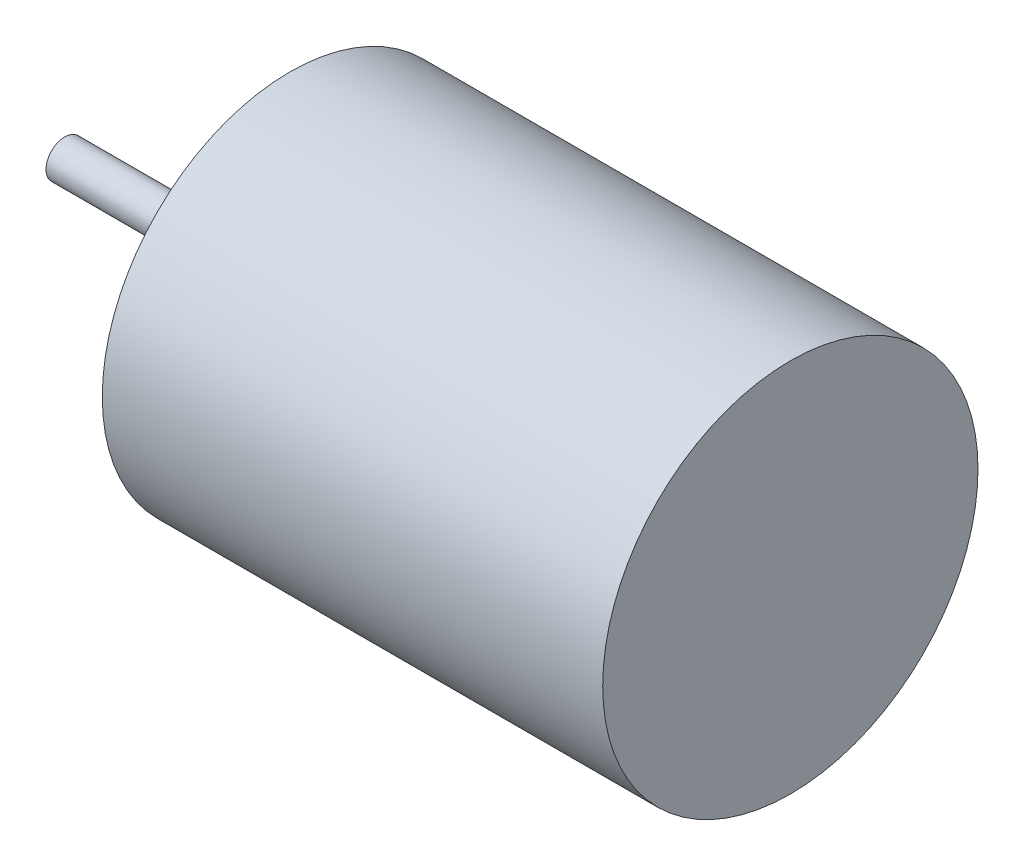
ISO-10303-21;
HEADER;
FILE_DESCRIPTION(('STEP AP214'),'2;1');
FILE_NAME('part.step','',(''),(''),'','','');
FILE_SCHEMA(('AUTOMOTIVE_DESIGN { 1 0 10303 214 1 1 1 1 }'));
ENDSEC;
DATA;
#1=APPLICATION_CONTEXT('core data for automotive mechanical design processes');
#2=APPLICATION_PROTOCOL_DEFINITION('international standard','automotive_design',2000,#1);
#3=PRODUCT_CONTEXT('',#1,'mechanical');
#4=PRODUCT('Part','Part','',(#3));
#5=PRODUCT_RELATED_PRODUCT_CATEGORY('part','',(#4));
#6=PRODUCT_DEFINITION_FORMATION('','',#4);
#7=PRODUCT_DEFINITION_CONTEXT('part definition',#1,'design');
#8=PRODUCT_DEFINITION('design','',#6,#7);
#9=PRODUCT_DEFINITION_SHAPE('','',#8);
#10=(LENGTH_UNIT() NAMED_UNIT(*) SI_UNIT(.MILLI.,.METRE.));
#11=(NAMED_UNIT(*) PLANE_ANGLE_UNIT() SI_UNIT($,.RADIAN.));
#12=(NAMED_UNIT(*) SI_UNIT($,.STERADIAN.) SOLID_ANGLE_UNIT());
#13=UNCERTAINTY_MEASURE_WITH_UNIT(LENGTH_MEASURE(1.E-05),#10,'distance_accuracy_value','');
#14=(GEOMETRIC_REPRESENTATION_CONTEXT(3) GLOBAL_UNCERTAINTY_ASSIGNED_CONTEXT((#13)) GLOBAL_UNIT_ASSIGNED_CONTEXT((#10,
#11,#12)) REPRESENTATION_CONTEXT('',''));
#15=CARTESIAN_POINT('',(0.,0.,0.));
#16=DIRECTION('',(0.,0.,1.));
#17=DIRECTION('',(1.,0.,0.));
#18=AXIS2_PLACEMENT_3D('',#15,#16,#17);
#19=CARTESIAN_POINT('',(35.,5.,-260.));
#20=DIRECTION('',(-1.,0.,0.));
#21=DIRECTION('',(0.,0.,1.));
#22=AXIS2_PLACEMENT_3D('',#19,#20,#21);
#23=CYLINDRICAL_SURFACE('',#22,15.);
#24=CARTESIAN_POINT('',(35.,5.,-260.));
#25=DIRECTION('',(-1.,0.,0.));
#26=DIRECTION('',(0.,0.,1.));
#27=AXIS2_PLACEMENT_3D('',#24,#25,#26);
#28=CIRCLE('',#27,15.);
#29=CARTESIAN_POINT('',(35.,5.,-245.));
#30=VERTEX_POINT('',#29);
#31=EDGE_CURVE('E35',#30,#30,#28,.T.);
#32=ORIENTED_EDGE('',*,*,#31,.T.);
#33=EDGE_LOOP('',(#32));
#34=FACE_BOUND('',#33,.T.);
#35=CARTESIAN_POINT('',(-5.,5.,-260.));
#36=DIRECTION('',(-1.,0.,0.));
#37=DIRECTION('',(0.,0.,1.));
#38=AXIS2_PLACEMENT_3D('',#35,#36,#37);
#39=CIRCLE('',#38,15.);
#40=CARTESIAN_POINT('',(-5.,5.,-245.));
#41=VERTEX_POINT('',#40);
#42=EDGE_CURVE('E39',#41,#41,#39,.T.);
#43=ORIENTED_EDGE('',*,*,#42,.F.);
#44=EDGE_LOOP('',(#43));
#45=FACE_BOUND('',#44,.T.);
#46=ADVANCED_FACE('F29',(#34,#45),#23,.T.);
#47=CARTESIAN_POINT('',(35.,5.,-260.));
#48=DIRECTION('',(-1.,0.,0.));
#49=DIRECTION('',(0.,0.,1.));
#50=AXIS2_PLACEMENT_3D('',#47,#48,#49);
#51=PLANE('',#50);
#52=ORIENTED_EDGE('',*,*,#31,.F.);
#53=EDGE_LOOP('',(#52));
#54=FACE_BOUND('',#53,.T.);
#55=ADVANCED_FACE('F60',(#54),#51,.F.);
#56=CARTESIAN_POINT('',(-5.,5.,-260.));
#57=DIRECTION('',(-1.,0.,0.));
#58=DIRECTION('',(0.,0.,1.));
#59=AXIS2_PLACEMENT_3D('',#56,#57,#58);
#60=PLANE('',#59);
#61=CARTESIAN_POINT('',(-5.,5.,-260.));
#62=DIRECTION('',(-1.,0.,0.));
#63=DIRECTION('',(0.,0.,1.));
#64=AXIS2_PLACEMENT_3D('',#61,#62,#63);
#65=CIRCLE('',#64,1.50000000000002);
#66=CARTESIAN_POINT('',(-5.,5.,-258.5));
#67=VERTEX_POINT('',#66);
#68=EDGE_CURVE('E10',#67,#67,#65,.T.);
#69=ORIENTED_EDGE('',*,*,#68,.F.);
#70=EDGE_LOOP('',(#69));
#71=FACE_BOUND('',#70,.T.);
#72=ORIENTED_EDGE('',*,*,#42,.T.);
#73=EDGE_LOOP('',(#72));
#74=FACE_BOUND('',#73,.T.);
#75=ADVANCED_FACE('F53',(#71,#74),#60,.T.);
#76=CARTESIAN_POINT('',(-0.757359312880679,5.,-260.));
#77=DIRECTION('',(-1.,0.,0.));
#78=DIRECTION('',(0.,0.,1.));
#79=AXIS2_PLACEMENT_3D('',#76,#77,#78);
#80=CYLINDRICAL_SURFACE('',#79,1.50000000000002);
#81=ORIENTED_EDGE('',*,*,#68,.T.);
#82=EDGE_LOOP('',(#81));
#83=FACE_BOUND('',#82,.T.);
#84=CARTESIAN_POINT('',(-23.,5.,-260.));
#85=DIRECTION('',(-1.,0.,0.));
#86=DIRECTION('',(0.,0.,1.));
#87=AXIS2_PLACEMENT_3D('',#84,#85,#86);
#88=CIRCLE('',#87,1.50000000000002);
#89=CARTESIAN_POINT('',(-23.,5.,-258.5));
#90=VERTEX_POINT('',#89);
#91=EDGE_CURVE('E44',#90,#90,#88,.T.);
#92=ORIENTED_EDGE('',*,*,#91,.F.);
#93=EDGE_LOOP('',(#92));
#94=FACE_BOUND('',#93,.T.);
#95=ADVANCED_FACE('F51',(#83,#94),#80,.T.);
#96=CARTESIAN_POINT('',(-23.,5.,-260.));
#97=DIRECTION('',(-1.,0.,0.));
#98=DIRECTION('',(0.,0.,1.));
#99=AXIS2_PLACEMENT_3D('',#96,#97,#98);
#100=PLANE('',#99);
#101=ORIENTED_EDGE('',*,*,#91,.T.);
#102=EDGE_LOOP('',(#101));
#103=FACE_BOUND('',#102,.T.);
#104=ADVANCED_FACE('F49',(#103),#100,.T.);
#105=CLOSED_SHELL('',(#46,#55,#75,#95,#104));
#106=MANIFOLD_SOLID_BREP('B2',#105);
#107=ADVANCED_BREP_SHAPE_REPRESENTATION('',(#18,#106),#14);
#108=SHAPE_DEFINITION_REPRESENTATION(#9,#107);
ENDSEC;
END-ISO-10303-21;
